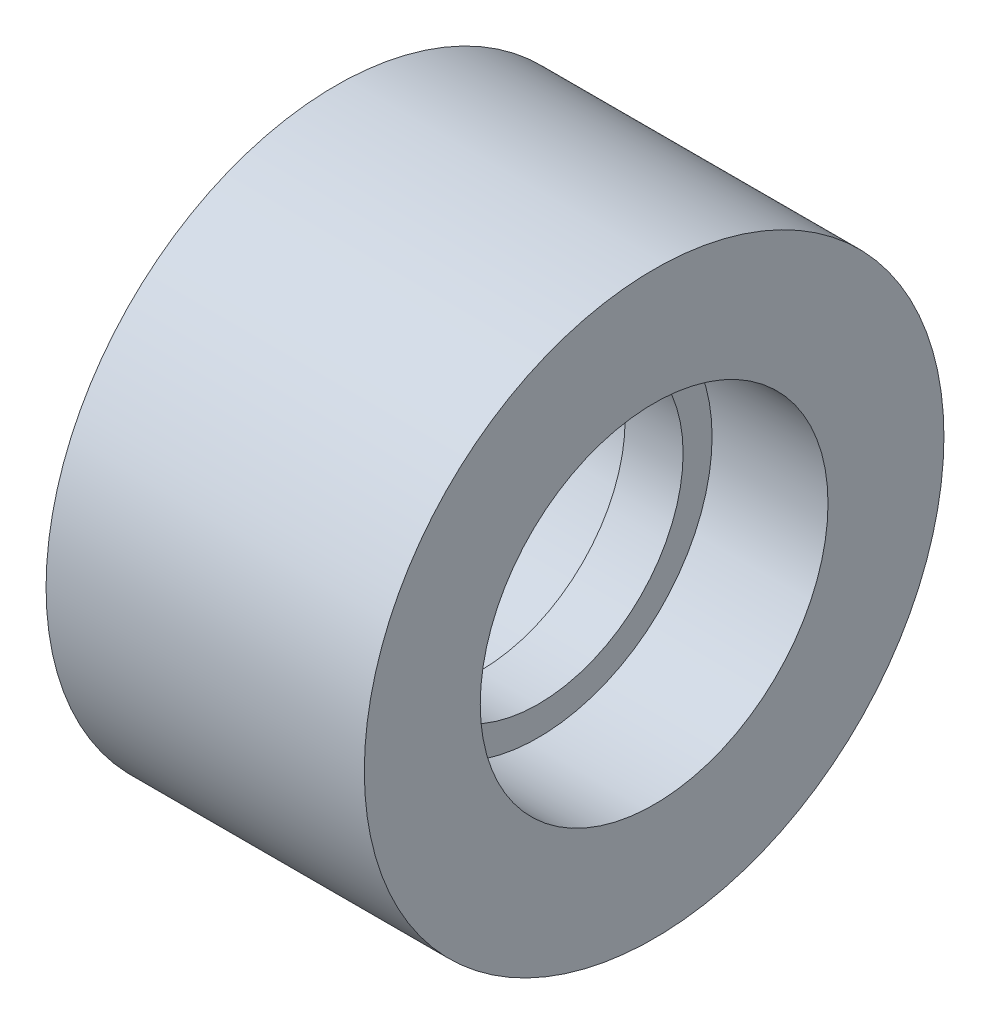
ISO-10303-21;
HEADER;
FILE_DESCRIPTION(('STEP AP214'),'2;1');
FILE_NAME('part.step','',(''),(''),'','','');
FILE_SCHEMA(('AUTOMOTIVE_DESIGN { 1 0 10303 214 1 1 1 1 }'));
ENDSEC;
DATA;
#1=APPLICATION_CONTEXT('core data for automotive mechanical design processes');
#2=APPLICATION_PROTOCOL_DEFINITION('international standard','automotive_design',2000,#1);
#3=PRODUCT_CONTEXT('',#1,'mechanical');
#4=PRODUCT('Part','Part','',(#3));
#5=PRODUCT_RELATED_PRODUCT_CATEGORY('part','',(#4));
#6=PRODUCT_DEFINITION_FORMATION('','',#4);
#7=PRODUCT_DEFINITION_CONTEXT('part definition',#1,'design');
#8=PRODUCT_DEFINITION('design','',#6,#7);
#9=PRODUCT_DEFINITION_SHAPE('','',#8);
#10=(LENGTH_UNIT() NAMED_UNIT(*) SI_UNIT(.MILLI.,.METRE.));
#11=(NAMED_UNIT(*) PLANE_ANGLE_UNIT() SI_UNIT($,.RADIAN.));
#12=(NAMED_UNIT(*) SI_UNIT($,.STERADIAN.) SOLID_ANGLE_UNIT());
#13=UNCERTAINTY_MEASURE_WITH_UNIT(LENGTH_MEASURE(1.E-05),#10,'distance_accuracy_value','');
#14=(GEOMETRIC_REPRESENTATION_CONTEXT(3) GLOBAL_UNCERTAINTY_ASSIGNED_CONTEXT((#13)) GLOBAL_UNIT_ASSIGNED_CONTEXT((#10,
#11,#12)) REPRESENTATION_CONTEXT('',''));
#15=CARTESIAN_POINT('',(0.,0.,0.));
#16=DIRECTION('',(0.,0.,1.));
#17=DIRECTION('',(1.,0.,0.));
#18=AXIS2_PLACEMENT_3D('',#15,#16,#17);
#19=CARTESIAN_POINT('',(0.,0.,0.));
#20=DIRECTION('',(1.,0.,0.));
#21=DIRECTION('',(0.,0.,-1.));
#22=AXIS2_PLACEMENT_3D('',#19,#20,#21);
#23=PLANE('',#22);
#24=CARTESIAN_POINT('',(0.,0.,0.));
#25=DIRECTION('',(-1.,0.,0.));
#26=DIRECTION('',(0.,0.,1.));
#27=AXIS2_PLACEMENT_3D('',#24,#25,#26);
#28=CIRCLE('',#27,3.6);
#29=CARTESIAN_POINT('',(0.,0.,3.6));
#30=VERTEX_POINT('',#29);
#31=EDGE_CURVE('E10',#30,#30,#28,.T.);
#32=ORIENTED_EDGE('',*,*,#31,.T.);
#33=EDGE_LOOP('',(#32));
#34=FACE_BOUND('',#33,.T.);
#35=ADVANCED_FACE('F30',(#34),#23,.F.);
#36=CARTESIAN_POINT('',(0.509558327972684,0.,0.));
#37=DIRECTION('',(1.,0.,0.));
#38=DIRECTION('',(0.,0.,-1.));
#39=AXIS2_PLACEMENT_3D('',#36,#37,#38);
#40=CONICAL_SURFACE('',#39,5.,1.22173047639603);
#41=ORIENTED_EDGE('',*,*,#31,.F.);
#42=EDGE_LOOP('',(#41));
#43=FACE_BOUND('',#42,.T.);
#44=CARTESIAN_POINT('',(0.509558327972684,0.,0.));
#45=DIRECTION('',(-1.,0.,0.));
#46=DIRECTION('',(0.,0.,1.));
#47=AXIS2_PLACEMENT_3D('',#44,#45,#46);
#48=CIRCLE('',#47,5.);
#49=CARTESIAN_POINT('',(0.509558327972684,0.,5.));
#50=VERTEX_POINT('',#49);
#51=EDGE_CURVE('E36',#50,#50,#48,.T.);
#52=ORIENTED_EDGE('',*,*,#51,.T.);
#53=EDGE_LOOP('',(#52));
#54=FACE_BOUND('',#53,.T.);
#55=ADVANCED_FACE('F77',(#43,#54),#40,.T.);
#56=CARTESIAN_POINT('',(-17.9481806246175,0.,0.));
#57=DIRECTION('',(-1.,0.,0.));
#58=DIRECTION('',(0.,0.,1.));
#59=AXIS2_PLACEMENT_3D('',#56,#57,#58);
#60=CYLINDRICAL_SURFACE('',#59,5.);
#61=ORIENTED_EDGE('',*,*,#51,.F.);
#62=EDGE_LOOP('',(#61));
#63=FACE_BOUND('',#62,.T.);
#64=CARTESIAN_POINT('',(6.,0.,0.));
#65=DIRECTION('',(-1.,0.,0.));
#66=DIRECTION('',(0.,0.,1.));
#67=AXIS2_PLACEMENT_3D('',#64,#65,#66);
#68=CIRCLE('',#67,5.);
#69=CARTESIAN_POINT('',(6.,0.,5.));
#70=VERTEX_POINT('',#69);
#71=EDGE_CURVE('E40',#70,#70,#68,.T.);
#72=ORIENTED_EDGE('',*,*,#71,.T.);
#73=EDGE_LOOP('',(#72));
#74=FACE_BOUND('',#73,.T.);
#75=ADVANCED_FACE('F81',(#63,#74),#60,.T.);
#76=CARTESIAN_POINT('',(6.,5.,0.));
#77=DIRECTION('',(-1.,0.,0.));
#78=DIRECTION('',(0.,0.,1.));
#79=AXIS2_PLACEMENT_3D('',#76,#77,#78);
#80=PLANE('',#79);
#81=ORIENTED_EDGE('',*,*,#71,.F.);
#82=EDGE_LOOP('',(#81));
#83=FACE_BOUND('',#82,.T.);
#84=CARTESIAN_POINT('',(6.,0.,0.));
#85=DIRECTION('',(-1.,0.,0.));
#86=DIRECTION('',(0.,0.,1.));
#87=AXIS2_PLACEMENT_3D('',#84,#85,#86);
#88=CIRCLE('',#87,3.);
#89=CARTESIAN_POINT('',(6.,0.,3.));
#90=VERTEX_POINT('',#89);
#91=EDGE_CURVE('E44',#90,#90,#88,.T.);
#92=ORIENTED_EDGE('',*,*,#91,.T.);
#93=EDGE_LOOP('',(#92));
#94=FACE_BOUND('',#93,.T.);
#95=ADVANCED_FACE('F86',(#83,#94),#80,.F.);
#96=CARTESIAN_POINT('',(-17.9481806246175,0.,0.));
#97=DIRECTION('',(-1.,0.,0.));
#98=DIRECTION('',(0.,0.,1.));
#99=AXIS2_PLACEMENT_3D('',#96,#97,#98);
#100=CYLINDRICAL_SURFACE('',#99,3.);
#101=ORIENTED_EDGE('',*,*,#91,.F.);
#102=EDGE_LOOP('',(#101));
#103=FACE_BOUND('',#102,.T.);
#104=CARTESIAN_POINT('',(4.,0.,0.));
#105=DIRECTION('',(-1.,0.,0.));
#106=DIRECTION('',(0.,0.,1.));
#107=AXIS2_PLACEMENT_3D('',#104,#105,#106);
#108=CIRCLE('',#107,3.);
#109=CARTESIAN_POINT('',(4.,0.,3.));
#110=VERTEX_POINT('',#109);
#111=EDGE_CURVE('E49',#110,#110,#108,.T.);
#112=ORIENTED_EDGE('',*,*,#111,.T.);
#113=EDGE_LOOP('',(#112));
#114=FACE_BOUND('',#113,.T.);
#115=ADVANCED_FACE('F92',(#103,#114),#100,.F.);
#116=CARTESIAN_POINT('',(4.,3.,0.));
#117=DIRECTION('',(-1.,0.,0.));
#118=DIRECTION('',(0.,0.,1.));
#119=AXIS2_PLACEMENT_3D('',#116,#117,#118);
#120=PLANE('',#119);
#121=ORIENTED_EDGE('',*,*,#111,.F.);
#122=EDGE_LOOP('',(#121));
#123=FACE_BOUND('',#122,.T.);
#124=CARTESIAN_POINT('',(4.,0.,0.));
#125=DIRECTION('',(-1.,0.,0.));
#126=DIRECTION('',(0.,0.,1.));
#127=AXIS2_PLACEMENT_3D('',#124,#125,#126);
#128=CIRCLE('',#127,2.5);
#129=CARTESIAN_POINT('',(4.,0.,2.5));
#130=VERTEX_POINT('',#129);
#131=EDGE_CURVE('E52',#130,#130,#128,.T.);
#132=ORIENTED_EDGE('',*,*,#131,.T.);
#133=EDGE_LOOP('',(#132));
#134=FACE_BOUND('',#133,.T.);
#135=ADVANCED_FACE('F96',(#123,#134),#120,.F.);
#136=CARTESIAN_POINT('',(-17.9481806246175,0.,0.));
#137=DIRECTION('',(-1.,0.,0.));
#138=DIRECTION('',(0.,0.,1.));
#139=AXIS2_PLACEMENT_3D('',#136,#137,#138);
#140=CYLINDRICAL_SURFACE('',#139,2.5);
#141=ORIENTED_EDGE('',*,*,#131,.F.);
#142=EDGE_LOOP('',(#141));
#143=FACE_BOUND('',#142,.T.);
#144=CARTESIAN_POINT('',(3.,0.,0.));
#145=DIRECTION('',(-1.,0.,0.));
#146=DIRECTION('',(0.,0.,1.));
#147=AXIS2_PLACEMENT_3D('',#144,#145,#146);
#148=CIRCLE('',#147,2.5);
#149=CARTESIAN_POINT('',(3.,0.,2.5));
#150=VERTEX_POINT('',#149);
#151=EDGE_CURVE('E55',#150,#150,#148,.T.);
#152=ORIENTED_EDGE('',*,*,#151,.T.);
#153=EDGE_LOOP('',(#152));
#154=FACE_BOUND('',#153,.T.);
#155=ADVANCED_FACE('F100',(#143,#154),#140,.F.);
#156=CARTESIAN_POINT('',(3.,2.5,0.));
#157=DIRECTION('',(1.,0.,0.));
#158=DIRECTION('',(0.,0.,-1.));
#159=AXIS2_PLACEMENT_3D('',#156,#157,#158);
#160=PLANE('',#159);
#161=ORIENTED_EDGE('',*,*,#151,.F.);
#162=EDGE_LOOP('',(#161));
#163=FACE_BOUND('',#162,.T.);
#164=CARTESIAN_POINT('',(3.,0.,0.));
#165=DIRECTION('',(-1.,0.,0.));
#166=DIRECTION('',(0.,0.,1.));
#167=AXIS2_PLACEMENT_3D('',#164,#165,#166);
#168=CIRCLE('',#167,3.);
#169=CARTESIAN_POINT('',(3.,0.,3.));
#170=VERTEX_POINT('',#169);
#171=EDGE_CURVE('E58',#170,#170,#168,.T.);
#172=ORIENTED_EDGE('',*,*,#171,.T.);
#173=EDGE_LOOP('',(#172));
#174=FACE_BOUND('',#173,.T.);
#175=ADVANCED_FACE('F73',(#163,#174),#160,.F.);
#176=CARTESIAN_POINT('',(-17.9481806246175,0.,0.));
#177=DIRECTION('',(-1.,0.,0.));
#178=DIRECTION('',(0.,0.,1.));
#179=AXIS2_PLACEMENT_3D('',#176,#177,#178);
#180=CYLINDRICAL_SURFACE('',#179,3.);
#181=ORIENTED_EDGE('',*,*,#171,.F.);
#182=EDGE_LOOP('',(#181));
#183=FACE_BOUND('',#182,.T.);
#184=CARTESIAN_POINT('',(1.,0.,0.));
#185=DIRECTION('',(-1.,0.,0.));
#186=DIRECTION('',(0.,0.,1.));
#187=AXIS2_PLACEMENT_3D('',#184,#185,#186);
#188=CIRCLE('',#187,3.);
#189=CARTESIAN_POINT('',(1.,0.,3.));
#190=VERTEX_POINT('',#189);
#191=EDGE_CURVE('E61',#190,#190,#188,.T.);
#192=ORIENTED_EDGE('',*,*,#191,.T.);
#193=EDGE_LOOP('',(#192));
#194=FACE_BOUND('',#193,.T.);
#195=ADVANCED_FACE('F65',(#183,#194),#180,.F.);
#196=CARTESIAN_POINT('',(1.,3.,0.));
#197=DIRECTION('',(-1.,0.,0.));
#198=DIRECTION('',(0.,0.,1.));
#199=AXIS2_PLACEMENT_3D('',#196,#197,#198);
#200=PLANE('',#199);
#201=ORIENTED_EDGE('',*,*,#191,.F.);
#202=EDGE_LOOP('',(#201));
#203=FACE_BOUND('',#202,.T.);
#204=ADVANCED_FACE('F67',(#203),#200,.F.);
#205=CLOSED_SHELL('',(#35,#55,#75,#95,#115,#135,#155,#175,#195,#204));
#206=MANIFOLD_SOLID_BREP('B2',#205);
#207=ADVANCED_BREP_SHAPE_REPRESENTATION('',(#18,#206),#14);
#208=SHAPE_DEFINITION_REPRESENTATION(#9,#207);
ENDSEC;
END-ISO-10303-21;
